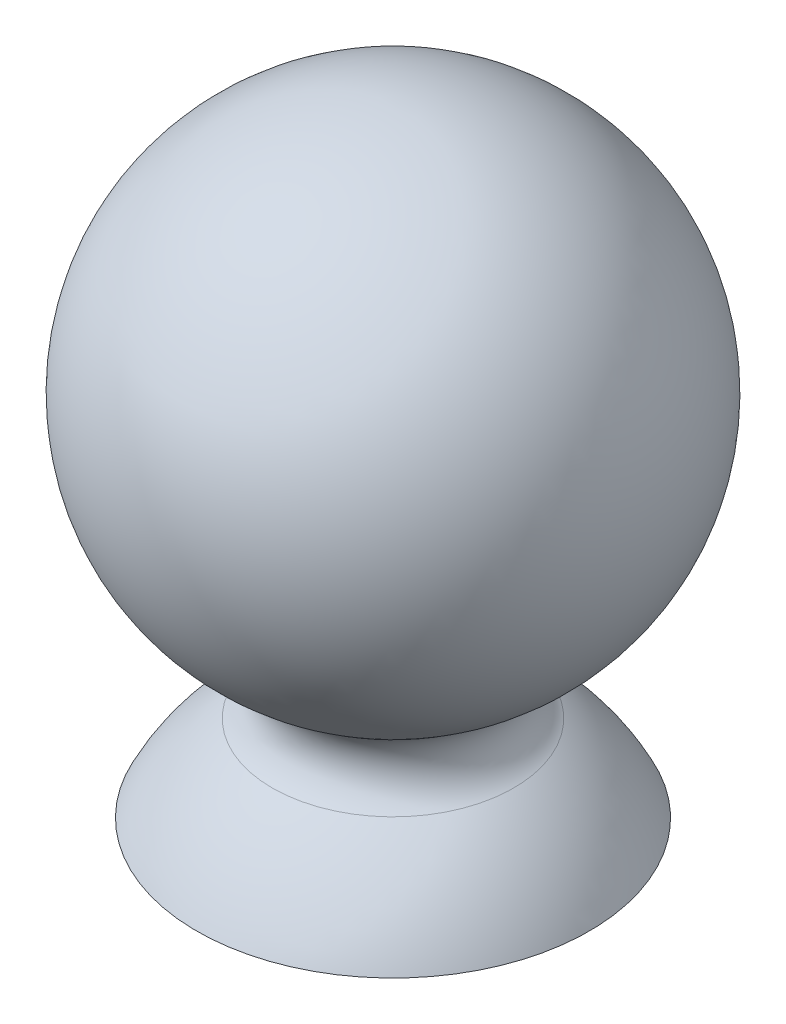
ISO-10303-21;
HEADER;
FILE_DESCRIPTION(('STEP AP214'),'2;1');
FILE_NAME('part.step','',(''),(''),'','','');
FILE_SCHEMA(('AUTOMOTIVE_DESIGN { 1 0 10303 214 1 1 1 1 }'));
ENDSEC;
DATA;
#1=APPLICATION_CONTEXT('core data for automotive mechanical design processes');
#2=APPLICATION_PROTOCOL_DEFINITION('international standard','automotive_design',2000,#1);
#3=PRODUCT_CONTEXT('',#1,'mechanical');
#4=PRODUCT('Part','Part','',(#3));
#5=PRODUCT_RELATED_PRODUCT_CATEGORY('part','',(#4));
#6=PRODUCT_DEFINITION_FORMATION('','',#4);
#7=PRODUCT_DEFINITION_CONTEXT('part definition',#1,'design');
#8=PRODUCT_DEFINITION('design','',#6,#7);
#9=PRODUCT_DEFINITION_SHAPE('','',#8);
#10=(LENGTH_UNIT() NAMED_UNIT(*) SI_UNIT(.MILLI.,.METRE.));
#11=(NAMED_UNIT(*) PLANE_ANGLE_UNIT() SI_UNIT($,.RADIAN.));
#12=(NAMED_UNIT(*) SI_UNIT($,.STERADIAN.) SOLID_ANGLE_UNIT());
#13=UNCERTAINTY_MEASURE_WITH_UNIT(LENGTH_MEASURE(1.E-05),#10,'distance_accuracy_value','');
#14=(GEOMETRIC_REPRESENTATION_CONTEXT(3) GLOBAL_UNCERTAINTY_ASSIGNED_CONTEXT((#13)) GLOBAL_UNIT_ASSIGNED_CONTEXT((#10,
#11,#12)) REPRESENTATION_CONTEXT('',''));
#15=CARTESIAN_POINT('',(0.,0.,0.));
#16=DIRECTION('',(0.,0.,1.));
#17=DIRECTION('',(1.,0.,0.));
#18=AXIS2_PLACEMENT_3D('',#15,#16,#17);
#19=CARTESIAN_POINT('',(0.,-45.,0.));
#20=DIRECTION('',(0.,-1.,0.));
#21=DIRECTION('',(0.,0.,-1.));
#22=AXIS2_PLACEMENT_3D('',#19,#20,#21);
#23=PLANE('',#22);
#24=CARTESIAN_POINT('',(0.,-45.,-65.1728853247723));
#25=DIRECTION('',(0.,-1.,0.));
#26=DIRECTION('',(0.,0.,1.));
#27=AXIS2_PLACEMENT_3D('',#24,#25,#26);
#28=CIRCLE('',#27,80.);
#29=CARTESIAN_POINT('',(-13.6534076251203,-45.,13.6534076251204));
#30=VERTEX_POINT('',#29);
#31=CARTESIAN_POINT('',(-17.,-45.,13.));
#32=VERTEX_POINT('',#31);
#33=EDGE_CURVE('E47',#30,#32,#28,.T.);
#34=ORIENTED_EDGE('',*,*,#33,.F.);
#35=CARTESIAN_POINT('',(65.1728853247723,-45.,-6.82649738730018E-13));
#36=DIRECTION('',(0.,-1.,0.));
#37=DIRECTION('',(0.,0.,1.));
#38=AXIS2_PLACEMENT_3D('',#35,#36,#37);
#39=CIRCLE('',#38,80.);
#40=CARTESIAN_POINT('',(-12.9999999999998,-45.,17.0000000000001));
#41=VERTEX_POINT('',#40);
#42=EDGE_CURVE('E310',#41,#30,#39,.T.);
#43=ORIENTED_EDGE('',*,*,#42,.F.);
#44=DIRECTION('',(-1.,0.,0.));
#45=VECTOR('',#44,1.);
#46=CARTESIAN_POINT('',(-12.9999999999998,-45.,17.0000000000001));
#47=LINE('',#46,#45);
#48=CARTESIAN_POINT('',(-9.99999999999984,-45.,17.0000000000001));
#49=VERTEX_POINT('',#48);
#50=EDGE_CURVE('E468',#49,#41,#47,.T.);
#51=ORIENTED_EDGE('',*,*,#50,.F.);
#52=CARTESIAN_POINT('',(67.4051839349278,-45.,-7.06031825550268E-13));
#53=DIRECTION('',(0.,1.,0.));
#54=DIRECTION('',(0.,0.,1.));
#55=AXIS2_PLACEMENT_3D('',#52,#53,#54);
#56=CIRCLE('',#55,79.25);
#57=CARTESIAN_POINT('',(-10.5758880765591,-45.,14.1249746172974));
#58=VERTEX_POINT('',#57);
#59=EDGE_CURVE('E465',#58,#49,#56,.T.);
#60=ORIENTED_EDGE('',*,*,#59,.F.);
#61=CARTESIAN_POINT('',(0.,-45.,-65.1728853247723));
#62=DIRECTION('',(0.,-1.,0.));
#63=DIRECTION('',(0.,0.,1.));
#64=AXIS2_PLACEMENT_3D('',#61,#62,#63);
#65=CIRCLE('',#64,80.);
#66=CARTESIAN_POINT('',(10.5758880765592,-45.,14.1249746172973));
#67=VERTEX_POINT('',#66);
#68=EDGE_CURVE('E462',#67,#58,#65,.T.);
#69=ORIENTED_EDGE('',*,*,#68,.F.);
#70=CARTESIAN_POINT('',(-67.4051839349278,-45.,2.38813388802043E-13));
#71=DIRECTION('',(0.,1.,0.));
#72=DIRECTION('',(0.,0.,1.));
#73=AXIS2_PLACEMENT_3D('',#70,#71,#72);
#74=CIRCLE('',#73,79.25);
#75=CARTESIAN_POINT('',(10.0000000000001,-45.,17.));
#76=VERTEX_POINT('',#75);
#77=EDGE_CURVE('E459',#76,#67,#74,.T.);
#78=ORIENTED_EDGE('',*,*,#77,.F.);
#79=DIRECTION('',(-1.,0.,0.));
#80=VECTOR('',#79,1.);
#81=CARTESIAN_POINT('',(13.0000000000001,-45.,17.));
#82=LINE('',#81,#80);
#83=CARTESIAN_POINT('',(13.0000000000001,-45.,17.));
#84=VERTEX_POINT('',#83);
#85=EDGE_CURVE('E456',#84,#76,#82,.T.);
#86=ORIENTED_EDGE('',*,*,#85,.F.);
#87=CARTESIAN_POINT('',(-65.1728853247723,-45.,2.3101935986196E-13));
#88=DIRECTION('',(0.,-1.,0.));
#89=DIRECTION('',(0.,0.,1.));
#90=AXIS2_PLACEMENT_3D('',#87,#88,#89);
#91=CIRCLE('',#90,80.);
#92=CARTESIAN_POINT('',(13.6534076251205,-45.,13.6534076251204));
#93=VERTEX_POINT('',#92);
#94=EDGE_CURVE('E453',#93,#84,#91,.T.);
#95=ORIENTED_EDGE('',*,*,#94,.F.);
#96=CARTESIAN_POINT('',(0.,-45.,-65.1728853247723));
#97=DIRECTION('',(0.,-1.,0.));
#98=DIRECTION('',(0.,0.,1.));
#99=AXIS2_PLACEMENT_3D('',#96,#97,#98);
#100=CIRCLE('',#99,80.);
#101=CARTESIAN_POINT('',(17.,-45.,13.));
#102=VERTEX_POINT('',#101);
#103=EDGE_CURVE('E450',#102,#93,#100,.T.);
#104=ORIENTED_EDGE('',*,*,#103,.F.);
#105=DIRECTION('',(0.,0.,1.));
#106=VECTOR('',#105,1.);
#107=CARTESIAN_POINT('',(17.,-45.,13.));
#108=LINE('',#107,#106);
#109=CARTESIAN_POINT('',(17.,-45.,9.99999999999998));
#110=VERTEX_POINT('',#109);
#111=EDGE_CURVE('E447',#110,#102,#108,.T.);
#112=ORIENTED_EDGE('',*,*,#111,.F.);
#113=CARTESIAN_POINT('',(0.,-45.,-67.4051839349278));
#114=DIRECTION('',(0.,1.,0.));
#115=DIRECTION('',(0.,0.,1.));
#116=AXIS2_PLACEMENT_3D('',#113,#114,#115);
#117=CIRCLE('',#116,79.25);
#118=CARTESIAN_POINT('',(14.1249746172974,-45.,10.5758880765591));
#119=VERTEX_POINT('',#118);
#120=EDGE_CURVE('E444',#119,#110,#117,.T.);
#121=ORIENTED_EDGE('',*,*,#120,.F.);
#122=CARTESIAN_POINT('',(-65.1728853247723,-45.,2.3101935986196E-13));
#123=DIRECTION('',(0.,-1.,0.));
#124=DIRECTION('',(0.,0.,1.));
#125=AXIS2_PLACEMENT_3D('',#122,#123,#124);
#126=CIRCLE('',#125,80.);
#127=CARTESIAN_POINT('',(14.1249746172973,-45.,-10.5758880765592));
#128=VERTEX_POINT('',#127);
#129=EDGE_CURVE('E441',#128,#119,#126,.T.);
#130=ORIENTED_EDGE('',*,*,#129,.F.);
#131=CARTESIAN_POINT('',(4.70687883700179E-13,-45.,67.4051839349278));
#132=DIRECTION('',(0.,1.,0.));
#133=DIRECTION('',(0.,0.,1.));
#134=AXIS2_PLACEMENT_3D('',#131,#132,#133);
#135=CIRCLE('',#134,79.25);
#136=CARTESIAN_POINT('',(16.9999999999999,-45.,-10.0000000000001));
#137=VERTEX_POINT('',#136);
#138=EDGE_CURVE('E438',#137,#128,#135,.T.);
#139=ORIENTED_EDGE('',*,*,#138,.F.);
#140=DIRECTION('',(0.,0.,1.));
#141=VECTOR('',#140,1.);
#142=CARTESIAN_POINT('',(16.9999999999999,-45.,-13.0000000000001));
#143=LINE('',#142,#141);
#144=CARTESIAN_POINT('',(16.9999999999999,-45.,-13.0000000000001));
#145=VERTEX_POINT('',#144);
#146=EDGE_CURVE('E435',#145,#137,#143,.T.);
#147=ORIENTED_EDGE('',*,*,#146,.F.);
#148=CARTESIAN_POINT('',(4.55099825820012E-13,-45.,65.1728853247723));
#149=DIRECTION('',(0.,-1.,0.));
#150=DIRECTION('',(0.,0.,1.));
#151=AXIS2_PLACEMENT_3D('',#148,#149,#150);
#152=CIRCLE('',#151,80.);
#153=CARTESIAN_POINT('',(13.6534076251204,-45.,-13.6534076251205));
#154=VERTEX_POINT('',#153);
#155=EDGE_CURVE('E432',#154,#145,#152,.T.);
#156=ORIENTED_EDGE('',*,*,#155,.F.);
#157=CARTESIAN_POINT('',(-65.1728853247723,-45.,2.3101935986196E-13));
#158=DIRECTION('',(0.,-1.,0.));
#159=DIRECTION('',(0.,0.,1.));
#160=AXIS2_PLACEMENT_3D('',#157,#158,#159);
#161=CIRCLE('',#160,80.);
#162=CARTESIAN_POINT('',(12.9999999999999,-45.,-17.));
#163=VERTEX_POINT('',#162);
#164=EDGE_CURVE('E429',#163,#154,#161,.T.);
#165=ORIENTED_EDGE('',*,*,#164,.F.);
#166=DIRECTION('',(1.,0.,0.));
#167=VECTOR('',#166,1.);
#168=CARTESIAN_POINT('',(12.9999999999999,-45.,-17.));
#169=LINE('',#168,#167);
#170=CARTESIAN_POINT('',(9.99999999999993,-45.,-17.));
#171=VERTEX_POINT('',#170);
#172=EDGE_CURVE('E426',#171,#163,#169,.T.);
#173=ORIENTED_EDGE('',*,*,#172,.F.);
#174=CARTESIAN_POINT('',(-67.4051839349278,-45.,2.38813388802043E-13));
#175=DIRECTION('',(0.,1.,0.));
#176=DIRECTION('',(0.,0.,1.));
#177=AXIS2_PLACEMENT_3D('',#174,#175,#176);
#178=CIRCLE('',#177,79.25);
#179=CARTESIAN_POINT('',(10.575888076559,-45.,-14.1249746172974));
#180=VERTEX_POINT('',#179);
#181=EDGE_CURVE('E423',#180,#171,#178,.T.);
#182=ORIENTED_EDGE('',*,*,#181,.F.);
#183=CARTESIAN_POINT('',(4.55099825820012E-13,-45.,65.1728853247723));
#184=DIRECTION('',(0.,-1.,0.));
#185=DIRECTION('',(0.,0.,1.));
#186=AXIS2_PLACEMENT_3D('',#183,#184,#185);
#187=CIRCLE('',#186,80.);
#188=CARTESIAN_POINT('',(-10.5758880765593,-45.,-14.1249746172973));
#189=VERTEX_POINT('',#188);
#190=EDGE_CURVE('E420',#189,#180,#187,.T.);
#191=ORIENTED_EDGE('',*,*,#190,.F.);
#192=CARTESIAN_POINT('',(67.4051839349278,-45.,-7.06031825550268E-13));
#193=DIRECTION('',(0.,1.,0.));
#194=DIRECTION('',(0.,0.,1.));
#195=AXIS2_PLACEMENT_3D('',#192,#193,#194);
#196=CIRCLE('',#195,79.25);
#197=CARTESIAN_POINT('',(-10.0000000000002,-45.,-16.9999999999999));
#198=VERTEX_POINT('',#197);
#199=EDGE_CURVE('E417',#198,#189,#196,.T.);
#200=ORIENTED_EDGE('',*,*,#199,.F.);
#201=DIRECTION('',(1.,0.,0.));
#202=VECTOR('',#201,1.);
#203=CARTESIAN_POINT('',(-13.0000000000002,-45.,-16.9999999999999));
#204=LINE('',#203,#202);
#205=CARTESIAN_POINT('',(-13.0000000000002,-45.,-16.9999999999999));
#206=VERTEX_POINT('',#205);
#207=EDGE_CURVE('E414',#206,#198,#204,.T.);
#208=ORIENTED_EDGE('',*,*,#207,.F.);
#209=CARTESIAN_POINT('',(65.1728853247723,-45.,-6.82649738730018E-13));
#210=DIRECTION('',(0.,-1.,0.));
#211=DIRECTION('',(0.,0.,1.));
#212=AXIS2_PLACEMENT_3D('',#209,#210,#211);
#213=CIRCLE('',#212,80.);
#214=CARTESIAN_POINT('',(-13.6534076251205,-45.,-13.6534076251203));
#215=VERTEX_POINT('',#214);
#216=EDGE_CURVE('E411',#215,#206,#213,.T.);
#217=ORIENTED_EDGE('',*,*,#216,.F.);
#218=CARTESIAN_POINT('',(4.55099825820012E-13,-45.,65.1728853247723));
#219=DIRECTION('',(0.,-1.,0.));
#220=DIRECTION('',(0.,0.,1.));
#221=AXIS2_PLACEMENT_3D('',#218,#219,#220);
#222=CIRCLE('',#221,80.);
#223=CARTESIAN_POINT('',(-17.0000000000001,-45.,-12.9999999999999));
#224=VERTEX_POINT('',#223);
#225=EDGE_CURVE('E408',#224,#215,#222,.T.);
#226=ORIENTED_EDGE('',*,*,#225,.F.);
#227=DIRECTION('',(0.,0.,-1.));
#228=VECTOR('',#227,1.);
#229=CARTESIAN_POINT('',(-17.0000000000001,-45.,-12.9999999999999));
#230=LINE('',#229,#228);
#231=CARTESIAN_POINT('',(-17.,-45.,-9.99999999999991));
#232=VERTEX_POINT('',#231);
#233=EDGE_CURVE('E405',#232,#224,#230,.T.);
#234=ORIENTED_EDGE('',*,*,#233,.F.);
#235=CARTESIAN_POINT('',(4.70687883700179E-13,-45.,67.4051839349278));
#236=DIRECTION('',(0.,1.,0.));
#237=DIRECTION('',(0.,0.,1.));
#238=AXIS2_PLACEMENT_3D('',#235,#236,#237);
#239=CIRCLE('',#238,79.25);
#240=CARTESIAN_POINT('',(-14.1249746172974,-45.,-10.5758880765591));
#241=VERTEX_POINT('',#240);
#242=EDGE_CURVE('E402',#241,#232,#239,.T.);
#243=ORIENTED_EDGE('',*,*,#242,.F.);
#244=CARTESIAN_POINT('',(65.1728853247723,-45.,-6.82649738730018E-13));
#245=DIRECTION('',(0.,-1.,0.));
#246=DIRECTION('',(0.,0.,1.));
#247=AXIS2_PLACEMENT_3D('',#244,#245,#246);
#248=CIRCLE('',#247,80.);
#249=CARTESIAN_POINT('',(-14.1249746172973,-45.,10.5758880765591));
#250=VERTEX_POINT('',#249);
#251=EDGE_CURVE('E399',#250,#241,#248,.T.);
#252=ORIENTED_EDGE('',*,*,#251,.F.);
#253=CARTESIAN_POINT('',(0.,-45.,-67.4051839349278));
#254=DIRECTION('',(0.,1.,0.));
#255=DIRECTION('',(0.,0.,1.));
#256=AXIS2_PLACEMENT_3D('',#253,#254,#255);
#257=CIRCLE('',#256,79.25);
#258=CARTESIAN_POINT('',(-17.,-45.,10.));
#259=VERTEX_POINT('',#258);
#260=EDGE_CURVE('E396',#259,#250,#257,.T.);
#261=ORIENTED_EDGE('',*,*,#260,.F.);
#262=DIRECTION('',(0.,0.,-1.));
#263=VECTOR('',#262,1.);
#264=CARTESIAN_POINT('',(-17.,-45.,13.));
#265=LINE('',#264,#263);
#266=EDGE_CURVE('E393',#32,#259,#265,.T.);
#267=ORIENTED_EDGE('',*,*,#266,.F.);
#268=EDGE_LOOP('',(#34,#43,#51,#60,#69,#78,#86,#95,#104,#112,#121,#130,#139,#147,#156,#165,#173,
#182,#191,#200,#208,#217,#226,#234,#243,#252,#261,#267));
#269=FACE_BOUND('',#268,.T.);
#270=CARTESIAN_POINT('',(0.,-45.,0.));
#271=DIRECTION('',(0.,1.,0.));
#272=DIRECTION('',(0.,0.,1.));
#273=AXIS2_PLACEMENT_3D('',#270,#271,#272);
#274=CIRCLE('',#273,24.);
#275=CARTESIAN_POINT('',(-24.,-45.,0.));
#276=VERTEX_POINT('',#275);
#277=EDGE_CURVE('E554',#276,#276,#274,.T.);
#278=ORIENTED_EDGE('',*,*,#277,.F.);
#279=EDGE_LOOP('',(#278));
#280=FACE_BOUND('',#279,.T.);
#281=ADVANCED_FACE('F33',(#269,#280),#23,.T.);
#282=CARTESIAN_POINT('',(0.,0.,0.));
#283=DIRECTION('',(0.,1.,0.));
#284=DIRECTION('',(1.,0.,0.));
#285=AXIS2_PLACEMENT_3D('',#282,#283,#284);
#286=SPHERICAL_SURFACE('',#285,30.);
#287=CARTESIAN_POINT('',(0.,-25.9637188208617,0.));
#288=DIRECTION('',(0.,1.,0.));
#289=DIRECTION('',(0.,0.,1.));
#290=AXIS2_PLACEMENT_3D('',#287,#288,#289);
#291=CIRCLE('',#290,15.0294811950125);
#292=CARTESIAN_POINT('',(0.,-25.9637188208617,15.0294811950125));
#293=VERTEX_POINT('',#292);
#294=EDGE_CURVE('E11',#293,#293,#291,.T.);
#295=ORIENTED_EDGE('',*,*,#294,.T.);
#296=EDGE_LOOP('',(#295));
#297=FACE_BOUND('',#296,.T.);
#298=ADVANCED_FACE('F580',(#297),#286,.T.);
#299=CARTESIAN_POINT('',(0.,-30.2910052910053,0.));
#300=DIRECTION('',(0.,1.,0.));
#301=DIRECTION('',(0.,0.,1.));
#302=AXIS2_PLACEMENT_3D('',#299,#300,#301);
#303=TOROIDAL_SURFACE('',#302,17.5343947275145,4.99999999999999);
#304=CARTESIAN_POINT('',(0.,-34.4564618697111,0.));
#305=DIRECTION('',(0.,1.,0.));
#306=DIRECTION('',(0.,0.,1.));
#307=AXIS2_PLACEMENT_3D('',#304,#305,#306);
#308=CIRCLE('',#307,14.7687173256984);
#309=CARTESIAN_POINT('',(-14.7687173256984,-34.4564618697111,0.));
#310=VERTEX_POINT('',#309);
#311=EDGE_CURVE('E40',#310,#310,#308,.T.);
#312=ORIENTED_EDGE('',*,*,#311,.T.);
#313=EDGE_LOOP('',(#312));
#314=FACE_BOUND('',#313,.T.);
#315=ORIENTED_EDGE('',*,*,#294,.F.);
#316=EDGE_LOOP('',(#315));
#317=FACE_BOUND('',#316,.T.);
#318=ADVANCED_FACE('F565',(#314,#317),#303,.F.);
#319=CARTESIAN_POINT('',(0.,-56.7,0.));
#320=DIRECTION('',(0.,1.,0.));
#321=DIRECTION('',(-1.,0.,0.));
#322=AXIS2_PLACEMENT_3D('',#319,#320,#321);
#323=SPHERICAL_SURFACE('',#322,26.7);
#324=CARTESIAN_POINT('',(-24.,-45.,0.));
#325=CARTESIAN_POINT('',(-23.9352752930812,-44.8672310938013,0.));
#326=CARTESIAN_POINT('',(-23.8694486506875,-44.7349993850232,0.));
#327=CARTESIAN_POINT('',(-23.7356100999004,-44.4716465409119,0.));
#328=CARTESIAN_POINT('',(-23.6675981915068,-44.3405254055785,0.));
#329=CARTESIAN_POINT('',(-23.5294077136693,-44.07942988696,0.));
#330=CARTESIAN_POINT('',(-23.4592291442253,-43.9494555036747,0.));
#331=CARTESIAN_POINT('',(-23.31672470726,-43.690689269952,0.));
#332=CARTESIAN_POINT('',(-23.2443988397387,-43.5618974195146,0.));
#333=CARTESIAN_POINT('',(-23.0976197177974,-43.30553172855,0.));
#334=CARTESIAN_POINT('',(-23.0231664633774,-43.1779578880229,0.));
#335=CARTESIAN_POINT('',(-22.8721530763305,-42.9240633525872,0.));
#336=CARTESIAN_POINT('',(-22.7955929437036,-42.7977426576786,0.));
#337=CARTESIAN_POINT('',(-22.6403868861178,-42.5463892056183,0.));
#338=CARTESIAN_POINT('',(-22.5617409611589,-42.4213564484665,0.));
#339=CARTESIAN_POINT('',(-22.4023849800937,-42.1726133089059,0.));
#340=CARTESIAN_POINT('',(-22.3216749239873,-42.048902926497,0.));
#341=CARTESIAN_POINT('',(-22.1582129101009,-41.8028386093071,0.));
#342=CARTESIAN_POINT('',(-22.0754609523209,-41.6804846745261,0.));
#343=CARTESIAN_POINT('',(-21.9079379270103,-41.4371669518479,0.));
#344=CARTESIAN_POINT('',(-21.8231668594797,-41.3162031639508,0.));
#345=CARTESIAN_POINT('',(-21.6516289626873,-41.0756990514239,0.));
#346=CARTESIAN_POINT('',(-21.5648621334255,-40.9561587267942,0.));
#347=CARTESIAN_POINT('',(-21.3893566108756,-40.718534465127,0.));
#348=CARTESIAN_POINT('',(-21.3006179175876,-40.6004505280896,0.));
#349=CARTESIAN_POINT('',(-21.1211931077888,-40.3657715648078,0.));
#350=CARTESIAN_POINT('',(-21.030506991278,-40.2491765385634,0.));
#351=CARTESIAN_POINT('',(-20.8472123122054,-40.0175075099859,0.));
#352=CARTESIAN_POINT('',(-20.7546037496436,-39.9024335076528,0.));
#353=CARTESIAN_POINT('',(-20.5674896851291,-39.6738382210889,0.));
#354=CARTESIAN_POINT('',(-20.4729841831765,-39.5603169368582,0.));
#355=CARTESIAN_POINT('',(-20.282102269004,-39.3348583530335,0.));
#356=CARTESIAN_POINT('',(-20.1857258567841,-39.2229210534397,0.));
#357=CARTESIAN_POINT('',(-19.9911286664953,-39.0006612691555,0.));
#358=CARTESIAN_POINT('',(-19.8929078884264,-38.8903387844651,0.));
#359=CARTESIAN_POINT('',(-19.6946490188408,-38.6713390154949,0.));
#360=CARTESIAN_POINT('',(-19.5946109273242,-38.562661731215,0.));
#361=CARTESIAN_POINT('',(-19.3927449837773,-38.3469822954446,0.));
#362=CARTESIAN_POINT('',(-19.290917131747,-38.2399801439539,0.));
#363=CARTESIAN_POINT('',(-19.0854997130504,-38.0276804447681,0.));
#364=CARTESIAN_POINT('',(-18.9819101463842,-37.9223828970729,0.));
#365=CARTESIAN_POINT('',(-18.7729978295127,-37.7135214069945,0.));
#366=CARTESIAN_POINT('',(-18.6676750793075,-37.6099574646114,0.));
#367=CARTESIAN_POINT('',(-18.4553254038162,-37.4045917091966,0.));
#368=CARTESIAN_POINT('',(-18.3482984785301,-37.3027898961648,0.));
#369=CARTESIAN_POINT('',(-18.1325699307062,-37.1009764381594,0.));
#370=CARTESIAN_POINT('',(-18.0238683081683,-37.0009647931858,0.));
#371=CARTESIAN_POINT('',(-17.8048203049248,-36.8027592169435,0.));
#372=CARTESIAN_POINT('',(-17.6944739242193,-36.7045652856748,0.));
#373=CARTESIAN_POINT('',(-17.472166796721,-36.5100221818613,0.));
#374=CARTESIAN_POINT('',(-17.3602060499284,-36.4136730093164,0.));
#375=CARTESIAN_POINT('',(-17.1347010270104,-36.2228459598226,0.));
#376=CARTESIAN_POINT('',(-17.021156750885,-36.1283680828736,0.));
#377=CARTESIAN_POINT('',(-16.7925159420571,-35.941309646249,0.));
#378=CARTESIAN_POINT('',(-16.6774194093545,-35.8487290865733,0.));
#379=CARTESIAN_POINT('',(-16.4457057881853,-35.665490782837,0.));
#380=CARTESIAN_POINT('',(-16.3290886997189,-35.5748330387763,0.));
#381=CARTESIAN_POINT('',(-16.0943660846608,-35.3954653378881,0.));
#382=CARTESIAN_POINT('',(-15.9762605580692,-35.3067553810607,0.));
#383=CARTESIAN_POINT('',(-15.7385936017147,-35.1313076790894,0.));
#384=CARTESIAN_POINT('',(-15.6190321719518,-35.0445699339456,0.));
#385=CARTESIAN_POINT('',(-15.3784863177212,-34.8730905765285,0.));
#386=CARTESIAN_POINT('',(-15.2575018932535,-34.7883489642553,0.));
#387=CARTESIAN_POINT('',(-15.014143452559,-34.6208850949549,0.));
#388=CARTESIAN_POINT('',(-14.8917694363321,-34.5381628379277,0.));
#389=CARTESIAN_POINT('',(-14.7687173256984,-34.4564618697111,0.));
#390=B_SPLINE_CURVE_WITH_KNOTS('',3,(#324,#325,#326,#327,#328,#329,#330,#331,#332,#333,#334,
#335,#336,#337,#338,#339,#340,#341,#342,#343,#344,#345,#346,#347,#348,#349,#350,#351,#352,#353,
#354,#355,#356,#357,#358,#359,#360,#361,#362,#363,#364,#365,#366,#367,#368,#369,#370,#371,#372,
#373,#374,#375,#376,#377,#378,#379,#380,#381,#382,#383,#384,#385,#386,#387,#388,#389),
.UNSPECIFIED.,.F.,.F.,(4,2,2,2,2,2,2,2,2,2,2,2,2,2,2,2,2,2,2,2,2,2,2,2,2,2,2,2,2,2,2,2,4),(0.,
0.443110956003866,0.886221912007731,1.3293328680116,1.77244382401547,2.21555478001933,
2.6586657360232,3.10177669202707,3.54488764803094,3.98799860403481,4.43110956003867,
4.87422051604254,5.31733147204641,5.76044242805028,6.20355338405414,6.64666434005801,
7.08977529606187,7.53288625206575,7.97599720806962,8.41910816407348,8.86221912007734,
9.30533007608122,9.74844103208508,10.1915519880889,10.6346629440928,11.0777739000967,
11.5208848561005,11.9639958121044,12.4071067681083,12.8502177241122,13.293328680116,
13.7364396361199,14.1795505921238),.UNSPECIFIED.);
#391=EDGE_CURVE('BSEAM568',#276,#310,#390,.T.);
#392=ORIENTED_EDGE('',*,*,#277,.T.);
#393=ORIENTED_EDGE('',*,*,#311,.F.);
#394=ORIENTED_EDGE('',*,*,#391,.T.);
#395=ORIENTED_EDGE('',*,*,#391,.F.);
#396=EDGE_LOOP('',(#392,#394,#393,#395));
#397=FACE_BOUND('',#396,.T.);
#398=ADVANCED_FACE('F568',(#397),#323,.T.);
#399=CARTESIAN_POINT('',(0.,-41.,-65.1728853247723));
#400=DIRECTION('',(0.,-1.,0.));
#401=DIRECTION('',(0.,0.,-1.));
#402=AXIS2_PLACEMENT_3D('',#399,#400,#401);
#403=CYLINDRICAL_SURFACE('',#402,80.);
#404=ORIENTED_EDGE('',*,*,#33,.T.);
#405=DIRECTION('',(0.,-1.,0.));
#406=VECTOR('',#405,1.);
#407=CARTESIAN_POINT('',(-17.,-41.,13.));
#408=LINE('',#407,#406);
#409=CARTESIAN_POINT('',(-17.,-41.,13.));
#410=VERTEX_POINT('',#409);
#411=EDGE_CURVE('E391',#410,#32,#408,.T.);
#412=ORIENTED_EDGE('',*,*,#411,.F.);
#413=CARTESIAN_POINT('',(0.,-41.,-65.1728853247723));
#414=DIRECTION('',(0.,-1.,0.));
#415=DIRECTION('',(0.,0.,1.));
#416=AXIS2_PLACEMENT_3D('',#413,#414,#415);
#417=CIRCLE('',#416,80.);
#418=CARTESIAN_POINT('',(-13.6534076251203,-41.,13.6534076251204));
#419=VERTEX_POINT('',#418);
#420=EDGE_CURVE('E306',#419,#410,#417,.T.);
#421=ORIENTED_EDGE('',*,*,#420,.F.);
#422=DIRECTION('',(0.,-1.,0.));
#423=VECTOR('',#422,1.);
#424=CARTESIAN_POINT('',(-13.6534076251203,-41.,13.6534076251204));
#425=LINE('',#424,#423);
#426=EDGE_CURVE('E473',#419,#30,#425,.T.);
#427=ORIENTED_EDGE('',*,*,#426,.T.);
#428=EDGE_LOOP('',(#404,#412,#421,#427));
#429=FACE_BOUND('',#428,.T.);
#430=ADVANCED_FACE('F570',(#429),#403,.F.);
#431=CARTESIAN_POINT('',(65.1728853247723,-41.,-6.82649738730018E-13));
#432=DIRECTION('',(0.,-1.,0.));
#433=DIRECTION('',(0.,0.,-1.));
#434=AXIS2_PLACEMENT_3D('',#431,#432,#433);
#435=CYLINDRICAL_SURFACE('',#434,80.);
#436=ORIENTED_EDGE('',*,*,#42,.T.);
#437=ORIENTED_EDGE('',*,*,#426,.F.);
#438=CARTESIAN_POINT('',(65.1728853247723,-41.,-6.82649738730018E-13));
#439=DIRECTION('',(0.,-1.,0.));
#440=DIRECTION('',(0.,0.,1.));
#441=AXIS2_PLACEMENT_3D('',#438,#439,#440);
#442=CIRCLE('',#441,80.);
#443=CARTESIAN_POINT('',(-12.9999999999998,-41.,17.0000000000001));
#444=VERTEX_POINT('',#443);
#445=EDGE_CURVE('E388',#444,#419,#442,.T.);
#446=ORIENTED_EDGE('',*,*,#445,.F.);
#447=DIRECTION('',(0.,-1.,0.));
#448=VECTOR('',#447,1.);
#449=CARTESIAN_POINT('',(-12.9999999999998,-41.,17.0000000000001));
#450=LINE('',#449,#448);
#451=EDGE_CURVE('E476',#444,#41,#450,.T.);
#452=ORIENTED_EDGE('',*,*,#451,.T.);
#453=EDGE_LOOP('',(#436,#437,#446,#452));
#454=FACE_BOUND('',#453,.T.);
#455=ADVANCED_FACE('F578',(#454),#435,.F.);
#456=CARTESIAN_POINT('',(-12.9999999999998,-41.,17.0000000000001));
#457=DIRECTION('',(0.,0.,1.));
#458=DIRECTION('',(1.,0.,0.));
#459=AXIS2_PLACEMENT_3D('',#456,#457,#458);
#460=PLANE('',#459);
#461=ORIENTED_EDGE('',*,*,#50,.T.);
#462=ORIENTED_EDGE('',*,*,#451,.F.);
#463=DIRECTION('',(-1.,0.,0.));
#464=VECTOR('',#463,1.);
#465=CARTESIAN_POINT('',(-12.9999999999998,-41.,17.0000000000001));
#466=LINE('',#465,#464);
#467=CARTESIAN_POINT('',(-9.99999999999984,-41.,17.0000000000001));
#468=VERTEX_POINT('',#467);
#469=EDGE_CURVE('E385',#468,#444,#466,.T.);
#470=ORIENTED_EDGE('',*,*,#469,.F.);
#471=DIRECTION('',(0.,-1.,0.));
#472=VECTOR('',#471,1.);
#473=CARTESIAN_POINT('',(-9.99999999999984,-41.,17.0000000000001));
#474=LINE('',#473,#472);
#475=EDGE_CURVE('E478',#468,#49,#474,.T.);
#476=ORIENTED_EDGE('',*,*,#475,.T.);
#477=EDGE_LOOP('',(#461,#462,#470,#476));
#478=FACE_BOUND('',#477,.T.);
#479=ADVANCED_FACE('F626',(#478),#460,.F.);
#480=CARTESIAN_POINT('',(67.4051839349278,-41.,-7.06031825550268E-13));
#481=DIRECTION('',(0.,-1.,0.));
#482=DIRECTION('',(0.,0.,-1.));
#483=AXIS2_PLACEMENT_3D('',#480,#481,#482);
#484=CYLINDRICAL_SURFACE('',#483,79.25);
#485=ORIENTED_EDGE('',*,*,#59,.T.);
#486=ORIENTED_EDGE('',*,*,#475,.F.);
#487=CARTESIAN_POINT('',(67.4051839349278,-41.,-7.06031825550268E-13));
#488=DIRECTION('',(0.,1.,0.));
#489=DIRECTION('',(0.,0.,1.));
#490=AXIS2_PLACEMENT_3D('',#487,#488,#489);
#491=CIRCLE('',#490,79.25);
#492=CARTESIAN_POINT('',(-10.5758880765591,-41.,14.1249746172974));
#493=VERTEX_POINT('',#492);
#494=EDGE_CURVE('E382',#493,#468,#491,.T.);
#495=ORIENTED_EDGE('',*,*,#494,.F.);
#496=DIRECTION('',(0.,-1.,0.));
#497=VECTOR('',#496,1.);
#498=CARTESIAN_POINT('',(-10.5758880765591,-41.,14.1249746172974));
#499=LINE('',#498,#497);
#500=EDGE_CURVE('E480',#493,#58,#499,.T.);
#501=ORIENTED_EDGE('',*,*,#500,.T.);
#502=EDGE_LOOP('',(#485,#486,#495,#501));
#503=FACE_BOUND('',#502,.T.);
#504=ADVANCED_FACE('F630',(#503),#484,.T.);
#505=CARTESIAN_POINT('',(0.,-41.,-65.1728853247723));
#506=DIRECTION('',(0.,-1.,0.));
#507=DIRECTION('',(0.,0.,-1.));
#508=AXIS2_PLACEMENT_3D('',#505,#506,#507);
#509=CYLINDRICAL_SURFACE('',#508,80.);
#510=ORIENTED_EDGE('',*,*,#68,.T.);
#511=ORIENTED_EDGE('',*,*,#500,.F.);
#512=CARTESIAN_POINT('',(0.,-41.,-65.1728853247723));
#513=DIRECTION('',(0.,-1.,0.));
#514=DIRECTION('',(0.,0.,1.));
#515=AXIS2_PLACEMENT_3D('',#512,#513,#514);
#516=CIRCLE('',#515,80.);
#517=CARTESIAN_POINT('',(10.5758880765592,-41.,14.1249746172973));
#518=VERTEX_POINT('',#517);
#519=EDGE_CURVE('E379',#518,#493,#516,.T.);
#520=ORIENTED_EDGE('',*,*,#519,.F.);
#521=DIRECTION('',(0.,-1.,0.));
#522=VECTOR('',#521,1.);
#523=CARTESIAN_POINT('',(10.5758880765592,-41.,14.1249746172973));
#524=LINE('',#523,#522);
#525=EDGE_CURVE('E482',#518,#67,#524,.T.);
#526=ORIENTED_EDGE('',*,*,#525,.T.);
#527=EDGE_LOOP('',(#510,#511,#520,#526));
#528=FACE_BOUND('',#527,.T.);
#529=ADVANCED_FACE('F634',(#528),#509,.F.);
#530=CARTESIAN_POINT('',(-67.4051839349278,-41.,2.38813388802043E-13));
#531=DIRECTION('',(0.,-1.,0.));
#532=DIRECTION('',(0.,0.,-1.));
#533=AXIS2_PLACEMENT_3D('',#530,#531,#532);
#534=CYLINDRICAL_SURFACE('',#533,79.25);
#535=ORIENTED_EDGE('',*,*,#77,.T.);
#536=ORIENTED_EDGE('',*,*,#525,.F.);
#537=CARTESIAN_POINT('',(-67.4051839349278,-41.,2.38813388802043E-13));
#538=DIRECTION('',(0.,1.,0.));
#539=DIRECTION('',(0.,0.,1.));
#540=AXIS2_PLACEMENT_3D('',#537,#538,#539);
#541=CIRCLE('',#540,79.25);
#542=CARTESIAN_POINT('',(10.0000000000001,-41.,17.));
#543=VERTEX_POINT('',#542);
#544=EDGE_CURVE('E376',#543,#518,#541,.T.);
#545=ORIENTED_EDGE('',*,*,#544,.F.);
#546=DIRECTION('',(0.,-1.,0.));
#547=VECTOR('',#546,1.);
#548=CARTESIAN_POINT('',(10.0000000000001,-41.,17.));
#549=LINE('',#548,#547);
#550=EDGE_CURVE('E484',#543,#76,#549,.T.);
#551=ORIENTED_EDGE('',*,*,#550,.T.);
#552=EDGE_LOOP('',(#535,#536,#545,#551));
#553=FACE_BOUND('',#552,.T.);
#554=ADVANCED_FACE('F638',(#553),#534,.T.);
#555=CARTESIAN_POINT('',(13.0000000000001,-41.,17.));
#556=DIRECTION('',(0.,0.,1.));
#557=DIRECTION('',(1.,0.,0.));
#558=AXIS2_PLACEMENT_3D('',#555,#556,#557);
#559=PLANE('',#558);
#560=ORIENTED_EDGE('',*,*,#85,.T.);
#561=ORIENTED_EDGE('',*,*,#550,.F.);
#562=DIRECTION('',(-1.,0.,0.));
#563=VECTOR('',#562,1.);
#564=CARTESIAN_POINT('',(13.0000000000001,-41.,17.));
#565=LINE('',#564,#563);
#566=CARTESIAN_POINT('',(13.0000000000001,-41.,17.));
#567=VERTEX_POINT('',#566);
#568=EDGE_CURVE('E373',#567,#543,#565,.T.);
#569=ORIENTED_EDGE('',*,*,#568,.F.);
#570=DIRECTION('',(0.,-1.,0.));
#571=VECTOR('',#570,1.);
#572=CARTESIAN_POINT('',(13.0000000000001,-41.,17.));
#573=LINE('',#572,#571);
#574=EDGE_CURVE('E486',#567,#84,#573,.T.);
#575=ORIENTED_EDGE('',*,*,#574,.T.);
#576=EDGE_LOOP('',(#560,#561,#569,#575));
#577=FACE_BOUND('',#576,.T.);
#578=ADVANCED_FACE('F642',(#577),#559,.F.);
#579=CARTESIAN_POINT('',(-65.1728853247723,-41.,2.3101935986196E-13));
#580=DIRECTION('',(0.,-1.,0.));
#581=DIRECTION('',(0.,0.,-1.));
#582=AXIS2_PLACEMENT_3D('',#579,#580,#581);
#583=CYLINDRICAL_SURFACE('',#582,80.);
#584=ORIENTED_EDGE('',*,*,#94,.T.);
#585=ORIENTED_EDGE('',*,*,#574,.F.);
#586=CARTESIAN_POINT('',(-65.1728853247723,-41.,2.3101935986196E-13));
#587=DIRECTION('',(0.,-1.,0.));
#588=DIRECTION('',(0.,0.,1.));
#589=AXIS2_PLACEMENT_3D('',#586,#587,#588);
#590=CIRCLE('',#589,80.);
#591=CARTESIAN_POINT('',(13.6534076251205,-41.,13.6534076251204));
#592=VERTEX_POINT('',#591);
#593=EDGE_CURVE('E370',#592,#567,#590,.T.);
#594=ORIENTED_EDGE('',*,*,#593,.F.);
#595=DIRECTION('',(0.,-1.,0.));
#596=VECTOR('',#595,1.);
#597=CARTESIAN_POINT('',(13.6534076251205,-41.,13.6534076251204));
#598=LINE('',#597,#596);
#599=EDGE_CURVE('E488',#592,#93,#598,.T.);
#600=ORIENTED_EDGE('',*,*,#599,.T.);
#601=EDGE_LOOP('',(#584,#585,#594,#600));
#602=FACE_BOUND('',#601,.T.);
#603=ADVANCED_FACE('F646',(#602),#583,.F.);
#604=CARTESIAN_POINT('',(0.,-41.,-65.1728853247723));
#605=DIRECTION('',(0.,-1.,0.));
#606=DIRECTION('',(0.,0.,-1.));
#607=AXIS2_PLACEMENT_3D('',#604,#605,#606);
#608=CYLINDRICAL_SURFACE('',#607,80.);
#609=ORIENTED_EDGE('',*,*,#103,.T.);
#610=ORIENTED_EDGE('',*,*,#599,.F.);
#611=CARTESIAN_POINT('',(0.,-41.,-65.1728853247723));
#612=DIRECTION('',(0.,-1.,0.));
#613=DIRECTION('',(0.,0.,1.));
#614=AXIS2_PLACEMENT_3D('',#611,#612,#613);
#615=CIRCLE('',#614,80.);
#616=CARTESIAN_POINT('',(17.,-41.,13.));
#617=VERTEX_POINT('',#616);
#618=EDGE_CURVE('E367',#617,#592,#615,.T.);
#619=ORIENTED_EDGE('',*,*,#618,.F.);
#620=DIRECTION('',(0.,-1.,0.));
#621=VECTOR('',#620,1.);
#622=CARTESIAN_POINT('',(17.,-41.,13.));
#623=LINE('',#622,#621);
#624=EDGE_CURVE('E490',#617,#102,#623,.T.);
#625=ORIENTED_EDGE('',*,*,#624,.T.);
#626=EDGE_LOOP('',(#609,#610,#619,#625));
#627=FACE_BOUND('',#626,.T.);
#628=ADVANCED_FACE('F650',(#627),#608,.F.);
#629=CARTESIAN_POINT('',(17.,-41.,13.));
#630=DIRECTION('',(1.,0.,0.));
#631=DIRECTION('',(0.,0.,-1.));
#632=AXIS2_PLACEMENT_3D('',#629,#630,#631);
#633=PLANE('',#632);
#634=ORIENTED_EDGE('',*,*,#111,.T.);
#635=ORIENTED_EDGE('',*,*,#624,.F.);
#636=DIRECTION('',(0.,0.,1.));
#637=VECTOR('',#636,1.);
#638=CARTESIAN_POINT('',(17.,-41.,13.));
#639=LINE('',#638,#637);
#640=CARTESIAN_POINT('',(17.,-41.,9.99999999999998));
#641=VERTEX_POINT('',#640);
#642=EDGE_CURVE('E364',#641,#617,#639,.T.);
#643=ORIENTED_EDGE('',*,*,#642,.F.);
#644=DIRECTION('',(0.,-1.,0.));
#645=VECTOR('',#644,1.);
#646=CARTESIAN_POINT('',(17.,-41.,9.99999999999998));
#647=LINE('',#646,#645);
#648=EDGE_CURVE('E492',#641,#110,#647,.T.);
#649=ORIENTED_EDGE('',*,*,#648,.T.);
#650=EDGE_LOOP('',(#634,#635,#643,#649));
#651=FACE_BOUND('',#650,.T.);
#652=ADVANCED_FACE('F654',(#651),#633,.F.);
#653=CARTESIAN_POINT('',(0.,-41.,-67.4051839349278));
#654=DIRECTION('',(0.,-1.,0.));
#655=DIRECTION('',(0.,0.,-1.));
#656=AXIS2_PLACEMENT_3D('',#653,#654,#655);
#657=CYLINDRICAL_SURFACE('',#656,79.25);
#658=ORIENTED_EDGE('',*,*,#120,.T.);
#659=ORIENTED_EDGE('',*,*,#648,.F.);
#660=CARTESIAN_POINT('',(0.,-41.,-67.4051839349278));
#661=DIRECTION('',(0.,1.,0.));
#662=DIRECTION('',(0.,0.,1.));
#663=AXIS2_PLACEMENT_3D('',#660,#661,#662);
#664=CIRCLE('',#663,79.25);
#665=CARTESIAN_POINT('',(14.1249746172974,-41.,10.5758880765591));
#666=VERTEX_POINT('',#665);
#667=EDGE_CURVE('E361',#666,#641,#664,.T.);
#668=ORIENTED_EDGE('',*,*,#667,.F.);
#669=DIRECTION('',(0.,-1.,0.));
#670=VECTOR('',#669,1.);
#671=CARTESIAN_POINT('',(14.1249746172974,-41.,10.5758880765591));
#672=LINE('',#671,#670);
#673=EDGE_CURVE('E494',#666,#119,#672,.T.);
#674=ORIENTED_EDGE('',*,*,#673,.T.);
#675=EDGE_LOOP('',(#658,#659,#668,#674));
#676=FACE_BOUND('',#675,.T.);
#677=ADVANCED_FACE('F658',(#676),#657,.T.);
#678=CARTESIAN_POINT('',(-65.1728853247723,-41.,2.3101935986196E-13));
#679=DIRECTION('',(0.,-1.,0.));
#680=DIRECTION('',(0.,0.,-1.));
#681=AXIS2_PLACEMENT_3D('',#678,#679,#680);
#682=CYLINDRICAL_SURFACE('',#681,80.);
#683=ORIENTED_EDGE('',*,*,#129,.T.);
#684=ORIENTED_EDGE('',*,*,#673,.F.);
#685=CARTESIAN_POINT('',(-65.1728853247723,-41.,2.3101935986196E-13));
#686=DIRECTION('',(0.,-1.,0.));
#687=DIRECTION('',(0.,0.,1.));
#688=AXIS2_PLACEMENT_3D('',#685,#686,#687);
#689=CIRCLE('',#688,80.);
#690=CARTESIAN_POINT('',(14.1249746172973,-41.,-10.5758880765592));
#691=VERTEX_POINT('',#690);
#692=EDGE_CURVE('E358',#691,#666,#689,.T.);
#693=ORIENTED_EDGE('',*,*,#692,.F.);
#694=DIRECTION('',(0.,-1.,0.));
#695=VECTOR('',#694,1.);
#696=CARTESIAN_POINT('',(14.1249746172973,-41.,-10.5758880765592));
#697=LINE('',#696,#695);
#698=EDGE_CURVE('E496',#691,#128,#697,.T.);
#699=ORIENTED_EDGE('',*,*,#698,.T.);
#700=EDGE_LOOP('',(#683,#684,#693,#699));
#701=FACE_BOUND('',#700,.T.);
#702=ADVANCED_FACE('F662',(#701),#682,.F.);
#703=CARTESIAN_POINT('',(4.70687883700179E-13,-41.,67.4051839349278));
#704=DIRECTION('',(0.,-1.,0.));
#705=DIRECTION('',(0.,0.,-1.));
#706=AXIS2_PLACEMENT_3D('',#703,#704,#705);
#707=CYLINDRICAL_SURFACE('',#706,79.25);
#708=ORIENTED_EDGE('',*,*,#138,.T.);
#709=ORIENTED_EDGE('',*,*,#698,.F.);
#710=CARTESIAN_POINT('',(4.70687883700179E-13,-41.,67.4051839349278));
#711=DIRECTION('',(0.,1.,0.));
#712=DIRECTION('',(0.,0.,1.));
#713=AXIS2_PLACEMENT_3D('',#710,#711,#712);
#714=CIRCLE('',#713,79.25);
#715=CARTESIAN_POINT('',(16.9999999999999,-41.,-10.0000000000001));
#716=VERTEX_POINT('',#715);
#717=EDGE_CURVE('E355',#716,#691,#714,.T.);
#718=ORIENTED_EDGE('',*,*,#717,.F.);
#719=DIRECTION('',(0.,-1.,0.));
#720=VECTOR('',#719,1.);
#721=CARTESIAN_POINT('',(16.9999999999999,-41.,-10.0000000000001));
#722=LINE('',#721,#720);
#723=EDGE_CURVE('E498',#716,#137,#722,.T.);
#724=ORIENTED_EDGE('',*,*,#723,.T.);
#725=EDGE_LOOP('',(#708,#709,#718,#724));
#726=FACE_BOUND('',#725,.T.);
#727=ADVANCED_FACE('F666',(#726),#707,.T.);
#728=CARTESIAN_POINT('',(16.9999999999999,-41.,-13.0000000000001));
#729=DIRECTION('',(1.,0.,0.));
#730=DIRECTION('',(0.,0.,-1.));
#731=AXIS2_PLACEMENT_3D('',#728,#729,#730);
#732=PLANE('',#731);
#733=ORIENTED_EDGE('',*,*,#146,.T.);
#734=ORIENTED_EDGE('',*,*,#723,.F.);
#735=DIRECTION('',(0.,0.,1.));
#736=VECTOR('',#735,1.);
#737=CARTESIAN_POINT('',(16.9999999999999,-41.,-13.0000000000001));
#738=LINE('',#737,#736);
#739=CARTESIAN_POINT('',(16.9999999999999,-41.,-13.0000000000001));
#740=VERTEX_POINT('',#739);
#741=EDGE_CURVE('E352',#740,#716,#738,.T.);
#742=ORIENTED_EDGE('',*,*,#741,.F.);
#743=DIRECTION('',(0.,-1.,0.));
#744=VECTOR('',#743,1.);
#745=CARTESIAN_POINT('',(16.9999999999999,-41.,-13.0000000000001));
#746=LINE('',#745,#744);
#747=EDGE_CURVE('E500',#740,#145,#746,.T.);
#748=ORIENTED_EDGE('',*,*,#747,.T.);
#749=EDGE_LOOP('',(#733,#734,#742,#748));
#750=FACE_BOUND('',#749,.T.);
#751=ADVANCED_FACE('F670',(#750),#732,.F.);
#752=CARTESIAN_POINT('',(4.55099825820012E-13,-41.,65.1728853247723));
#753=DIRECTION('',(0.,-1.,0.));
#754=DIRECTION('',(0.,0.,-1.));
#755=AXIS2_PLACEMENT_3D('',#752,#753,#754);
#756=CYLINDRICAL_SURFACE('',#755,80.);
#757=ORIENTED_EDGE('',*,*,#155,.T.);
#758=ORIENTED_EDGE('',*,*,#747,.F.);
#759=CARTESIAN_POINT('',(4.55099825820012E-13,-41.,65.1728853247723));
#760=DIRECTION('',(0.,-1.,0.));
#761=DIRECTION('',(0.,0.,1.));
#762=AXIS2_PLACEMENT_3D('',#759,#760,#761);
#763=CIRCLE('',#762,80.);
#764=CARTESIAN_POINT('',(13.6534076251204,-41.,-13.6534076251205));
#765=VERTEX_POINT('',#764);
#766=EDGE_CURVE('E349',#765,#740,#763,.T.);
#767=ORIENTED_EDGE('',*,*,#766,.F.);
#768=DIRECTION('',(0.,-1.,0.));
#769=VECTOR('',#768,1.);
#770=CARTESIAN_POINT('',(13.6534076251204,-41.,-13.6534076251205));
#771=LINE('',#770,#769);
#772=EDGE_CURVE('E502',#765,#154,#771,.T.);
#773=ORIENTED_EDGE('',*,*,#772,.T.);
#774=EDGE_LOOP('',(#757,#758,#767,#773));
#775=FACE_BOUND('',#774,.T.);
#776=ADVANCED_FACE('F674',(#775),#756,.F.);
#777=CARTESIAN_POINT('',(-65.1728853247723,-41.,2.3101935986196E-13));
#778=DIRECTION('',(0.,-1.,0.));
#779=DIRECTION('',(0.,0.,-1.));
#780=AXIS2_PLACEMENT_3D('',#777,#778,#779);
#781=CYLINDRICAL_SURFACE('',#780,80.);
#782=ORIENTED_EDGE('',*,*,#164,.T.);
#783=ORIENTED_EDGE('',*,*,#772,.F.);
#784=CARTESIAN_POINT('',(-65.1728853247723,-41.,2.3101935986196E-13));
#785=DIRECTION('',(0.,-1.,0.));
#786=DIRECTION('',(0.,0.,1.));
#787=AXIS2_PLACEMENT_3D('',#784,#785,#786);
#788=CIRCLE('',#787,80.);
#789=CARTESIAN_POINT('',(12.9999999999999,-41.,-17.));
#790=VERTEX_POINT('',#789);
#791=EDGE_CURVE('E346',#790,#765,#788,.T.);
#792=ORIENTED_EDGE('',*,*,#791,.F.);
#793=DIRECTION('',(0.,-1.,0.));
#794=VECTOR('',#793,1.);
#795=CARTESIAN_POINT('',(12.9999999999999,-41.,-17.));
#796=LINE('',#795,#794);
#797=EDGE_CURVE('E504',#790,#163,#796,.T.);
#798=ORIENTED_EDGE('',*,*,#797,.T.);
#799=EDGE_LOOP('',(#782,#783,#792,#798));
#800=FACE_BOUND('',#799,.T.);
#801=ADVANCED_FACE('F678',(#800),#781,.F.);
#802=CARTESIAN_POINT('',(12.9999999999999,-41.,-17.));
#803=DIRECTION('',(0.,0.,-1.));
#804=DIRECTION('',(-1.,0.,0.));
#805=AXIS2_PLACEMENT_3D('',#802,#803,#804);
#806=PLANE('',#805);
#807=ORIENTED_EDGE('',*,*,#172,.T.);
#808=ORIENTED_EDGE('',*,*,#797,.F.);
#809=DIRECTION('',(1.,0.,0.));
#810=VECTOR('',#809,1.);
#811=CARTESIAN_POINT('',(12.9999999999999,-41.,-17.));
#812=LINE('',#811,#810);
#813=CARTESIAN_POINT('',(9.99999999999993,-41.,-17.));
#814=VERTEX_POINT('',#813);
#815=EDGE_CURVE('E343',#814,#790,#812,.T.);
#816=ORIENTED_EDGE('',*,*,#815,.F.);
#817=DIRECTION('',(0.,-1.,0.));
#818=VECTOR('',#817,1.);
#819=CARTESIAN_POINT('',(9.99999999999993,-41.,-17.));
#820=LINE('',#819,#818);
#821=EDGE_CURVE('E506',#814,#171,#820,.T.);
#822=ORIENTED_EDGE('',*,*,#821,.T.);
#823=EDGE_LOOP('',(#807,#808,#816,#822));
#824=FACE_BOUND('',#823,.T.);
#825=ADVANCED_FACE('F682',(#824),#806,.F.);
#826=CARTESIAN_POINT('',(-67.4051839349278,-41.,2.38813388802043E-13));
#827=DIRECTION('',(0.,-1.,0.));
#828=DIRECTION('',(0.,0.,-1.));
#829=AXIS2_PLACEMENT_3D('',#826,#827,#828);
#830=CYLINDRICAL_SURFACE('',#829,79.25);
#831=ORIENTED_EDGE('',*,*,#181,.T.);
#832=ORIENTED_EDGE('',*,*,#821,.F.);
#833=CARTESIAN_POINT('',(-67.4051839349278,-41.,2.38813388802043E-13));
#834=DIRECTION('',(0.,1.,0.));
#835=DIRECTION('',(0.,0.,1.));
#836=AXIS2_PLACEMENT_3D('',#833,#834,#835);
#837=CIRCLE('',#836,79.25);
#838=CARTESIAN_POINT('',(10.575888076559,-41.,-14.1249746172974));
#839=VERTEX_POINT('',#838);
#840=EDGE_CURVE('E340',#839,#814,#837,.T.);
#841=ORIENTED_EDGE('',*,*,#840,.F.);
#842=DIRECTION('',(0.,-1.,0.));
#843=VECTOR('',#842,1.);
#844=CARTESIAN_POINT('',(10.575888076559,-41.,-14.1249746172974));
#845=LINE('',#844,#843);
#846=EDGE_CURVE('E508',#839,#180,#845,.T.);
#847=ORIENTED_EDGE('',*,*,#846,.T.);
#848=EDGE_LOOP('',(#831,#832,#841,#847));
#849=FACE_BOUND('',#848,.T.);
#850=ADVANCED_FACE('F686',(#849),#830,.T.);
#851=CARTESIAN_POINT('',(4.55099825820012E-13,-41.,65.1728853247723));
#852=DIRECTION('',(0.,-1.,0.));
#853=DIRECTION('',(0.,0.,-1.));
#854=AXIS2_PLACEMENT_3D('',#851,#852,#853);
#855=CYLINDRICAL_SURFACE('',#854,80.);
#856=ORIENTED_EDGE('',*,*,#190,.T.);
#857=ORIENTED_EDGE('',*,*,#846,.F.);
#858=CARTESIAN_POINT('',(4.55099825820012E-13,-41.,65.1728853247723));
#859=DIRECTION('',(0.,-1.,0.));
#860=DIRECTION('',(0.,0.,1.));
#861=AXIS2_PLACEMENT_3D('',#858,#859,#860);
#862=CIRCLE('',#861,80.);
#863=CARTESIAN_POINT('',(-10.5758880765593,-41.,-14.1249746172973));
#864=VERTEX_POINT('',#863);
#865=EDGE_CURVE('E337',#864,#839,#862,.T.);
#866=ORIENTED_EDGE('',*,*,#865,.F.);
#867=DIRECTION('',(0.,-1.,0.));
#868=VECTOR('',#867,1.);
#869=CARTESIAN_POINT('',(-10.5758880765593,-41.,-14.1249746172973));
#870=LINE('',#869,#868);
#871=EDGE_CURVE('E510',#864,#189,#870,.T.);
#872=ORIENTED_EDGE('',*,*,#871,.T.);
#873=EDGE_LOOP('',(#856,#857,#866,#872));
#874=FACE_BOUND('',#873,.T.);
#875=ADVANCED_FACE('F690',(#874),#855,.F.);
#876=CARTESIAN_POINT('',(67.4051839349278,-41.,-7.06031825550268E-13));
#877=DIRECTION('',(0.,-1.,0.));
#878=DIRECTION('',(0.,0.,-1.));
#879=AXIS2_PLACEMENT_3D('',#876,#877,#878);
#880=CYLINDRICAL_SURFACE('',#879,79.25);
#881=ORIENTED_EDGE('',*,*,#199,.T.);
#882=ORIENTED_EDGE('',*,*,#871,.F.);
#883=CARTESIAN_POINT('',(67.4051839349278,-41.,-7.06031825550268E-13));
#884=DIRECTION('',(0.,1.,0.));
#885=DIRECTION('',(0.,0.,1.));
#886=AXIS2_PLACEMENT_3D('',#883,#884,#885);
#887=CIRCLE('',#886,79.25);
#888=CARTESIAN_POINT('',(-10.0000000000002,-41.,-16.9999999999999));
#889=VERTEX_POINT('',#888);
#890=EDGE_CURVE('E334',#889,#864,#887,.T.);
#891=ORIENTED_EDGE('',*,*,#890,.F.);
#892=DIRECTION('',(0.,-1.,0.));
#893=VECTOR('',#892,1.);
#894=CARTESIAN_POINT('',(-10.0000000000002,-41.,-16.9999999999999));
#895=LINE('',#894,#893);
#896=EDGE_CURVE('E512',#889,#198,#895,.T.);
#897=ORIENTED_EDGE('',*,*,#896,.T.);
#898=EDGE_LOOP('',(#881,#882,#891,#897));
#899=FACE_BOUND('',#898,.T.);
#900=ADVANCED_FACE('F694',(#899),#880,.T.);
#901=CARTESIAN_POINT('',(-13.0000000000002,-41.,-16.9999999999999));
#902=DIRECTION('',(0.,0.,-1.));
#903=DIRECTION('',(-1.,0.,0.));
#904=AXIS2_PLACEMENT_3D('',#901,#902,#903);
#905=PLANE('',#904);
#906=ORIENTED_EDGE('',*,*,#207,.T.);
#907=ORIENTED_EDGE('',*,*,#896,.F.);
#908=DIRECTION('',(1.,0.,0.));
#909=VECTOR('',#908,1.);
#910=CARTESIAN_POINT('',(-13.0000000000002,-41.,-16.9999999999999));
#911=LINE('',#910,#909);
#912=CARTESIAN_POINT('',(-13.0000000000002,-41.,-16.9999999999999));
#913=VERTEX_POINT('',#912);
#914=EDGE_CURVE('E331',#913,#889,#911,.T.);
#915=ORIENTED_EDGE('',*,*,#914,.F.);
#916=DIRECTION('',(0.,-1.,0.));
#917=VECTOR('',#916,1.);
#918=CARTESIAN_POINT('',(-13.0000000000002,-41.,-16.9999999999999));
#919=LINE('',#918,#917);
#920=EDGE_CURVE('E514',#913,#206,#919,.T.);
#921=ORIENTED_EDGE('',*,*,#920,.T.);
#922=EDGE_LOOP('',(#906,#907,#915,#921));
#923=FACE_BOUND('',#922,.T.);
#924=ADVANCED_FACE('F698',(#923),#905,.F.);
#925=CARTESIAN_POINT('',(65.1728853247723,-41.,-6.82649738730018E-13));
#926=DIRECTION('',(0.,-1.,0.));
#927=DIRECTION('',(0.,0.,-1.));
#928=AXIS2_PLACEMENT_3D('',#925,#926,#927);
#929=CYLINDRICAL_SURFACE('',#928,80.);
#930=ORIENTED_EDGE('',*,*,#216,.T.);
#931=ORIENTED_EDGE('',*,*,#920,.F.);
#932=CARTESIAN_POINT('',(65.1728853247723,-41.,-6.82649738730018E-13));
#933=DIRECTION('',(0.,-1.,0.));
#934=DIRECTION('',(0.,0.,1.));
#935=AXIS2_PLACEMENT_3D('',#932,#933,#934);
#936=CIRCLE('',#935,80.);
#937=CARTESIAN_POINT('',(-13.6534076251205,-41.,-13.6534076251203));
#938=VERTEX_POINT('',#937);
#939=EDGE_CURVE('E328',#938,#913,#936,.T.);
#940=ORIENTED_EDGE('',*,*,#939,.F.);
#941=DIRECTION('',(0.,-1.,0.));
#942=VECTOR('',#941,1.);
#943=CARTESIAN_POINT('',(-13.6534076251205,-41.,-13.6534076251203));
#944=LINE('',#943,#942);
#945=EDGE_CURVE('E516',#938,#215,#944,.T.);
#946=ORIENTED_EDGE('',*,*,#945,.T.);
#947=EDGE_LOOP('',(#930,#931,#940,#946));
#948=FACE_BOUND('',#947,.T.);
#949=ADVANCED_FACE('F702',(#948),#929,.F.);
#950=CARTESIAN_POINT('',(4.55099825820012E-13,-41.,65.1728853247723));
#951=DIRECTION('',(0.,-1.,0.));
#952=DIRECTION('',(0.,0.,-1.));
#953=AXIS2_PLACEMENT_3D('',#950,#951,#952);
#954=CYLINDRICAL_SURFACE('',#953,80.);
#955=ORIENTED_EDGE('',*,*,#225,.T.);
#956=ORIENTED_EDGE('',*,*,#945,.F.);
#957=CARTESIAN_POINT('',(4.55099825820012E-13,-41.,65.1728853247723));
#958=DIRECTION('',(0.,-1.,0.));
#959=DIRECTION('',(0.,0.,1.));
#960=AXIS2_PLACEMENT_3D('',#957,#958,#959);
#961=CIRCLE('',#960,80.);
#962=CARTESIAN_POINT('',(-17.0000000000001,-41.,-12.9999999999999));
#963=VERTEX_POINT('',#962);
#964=EDGE_CURVE('E325',#963,#938,#961,.T.);
#965=ORIENTED_EDGE('',*,*,#964,.F.);
#966=DIRECTION('',(0.,-1.,0.));
#967=VECTOR('',#966,1.);
#968=CARTESIAN_POINT('',(-17.0000000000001,-41.,-12.9999999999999));
#969=LINE('',#968,#967);
#970=EDGE_CURVE('E518',#963,#224,#969,.T.);
#971=ORIENTED_EDGE('',*,*,#970,.T.);
#972=EDGE_LOOP('',(#955,#956,#965,#971));
#973=FACE_BOUND('',#972,.T.);
#974=ADVANCED_FACE('F706',(#973),#954,.F.);
#975=CARTESIAN_POINT('',(-17.0000000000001,-41.,-12.9999999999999));
#976=DIRECTION('',(-1.,0.,0.));
#977=DIRECTION('',(0.,0.,1.));
#978=AXIS2_PLACEMENT_3D('',#975,#976,#977);
#979=PLANE('',#978);
#980=ORIENTED_EDGE('',*,*,#233,.T.);
#981=ORIENTED_EDGE('',*,*,#970,.F.);
#982=DIRECTION('',(0.,0.,-1.));
#983=VECTOR('',#982,1.);
#984=CARTESIAN_POINT('',(-17.0000000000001,-41.,-12.9999999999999));
#985=LINE('',#984,#983);
#986=CARTESIAN_POINT('',(-17.,-41.,-9.99999999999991));
#987=VERTEX_POINT('',#986);
#988=EDGE_CURVE('E322',#987,#963,#985,.T.);
#989=ORIENTED_EDGE('',*,*,#988,.F.);
#990=DIRECTION('',(0.,-1.,0.));
#991=VECTOR('',#990,1.);
#992=CARTESIAN_POINT('',(-17.,-41.,-9.99999999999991));
#993=LINE('',#992,#991);
#994=EDGE_CURVE('E520',#987,#232,#993,.T.);
#995=ORIENTED_EDGE('',*,*,#994,.T.);
#996=EDGE_LOOP('',(#980,#981,#989,#995));
#997=FACE_BOUND('',#996,.T.);
#998=ADVANCED_FACE('F710',(#997),#979,.F.);
#999=CARTESIAN_POINT('',(4.70687883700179E-13,-41.,67.4051839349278));
#1000=DIRECTION('',(0.,-1.,0.));
#1001=DIRECTION('',(0.,0.,-1.));
#1002=AXIS2_PLACEMENT_3D('',#999,#1000,#1001);
#1003=CYLINDRICAL_SURFACE('',#1002,79.25);
#1004=ORIENTED_EDGE('',*,*,#242,.T.);
#1005=ORIENTED_EDGE('',*,*,#994,.F.);
#1006=CARTESIAN_POINT('',(4.70687883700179E-13,-41.,67.4051839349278));
#1007=DIRECTION('',(0.,1.,0.));
#1008=DIRECTION('',(0.,0.,1.));
#1009=AXIS2_PLACEMENT_3D('',#1006,#1007,#1008);
#1010=CIRCLE('',#1009,79.25);
#1011=CARTESIAN_POINT('',(-14.1249746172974,-41.,-10.5758880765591));
#1012=VERTEX_POINT('',#1011);
#1013=EDGE_CURVE('E319',#1012,#987,#1010,.T.);
#1014=ORIENTED_EDGE('',*,*,#1013,.F.);
#1015=DIRECTION('',(0.,-1.,0.));
#1016=VECTOR('',#1015,1.);
#1017=CARTESIAN_POINT('',(-14.1249746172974,-41.,-10.5758880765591));
#1018=LINE('',#1017,#1016);
#1019=EDGE_CURVE('E522',#1012,#241,#1018,.T.);
#1020=ORIENTED_EDGE('',*,*,#1019,.T.);
#1021=EDGE_LOOP('',(#1004,#1005,#1014,#1020));
#1022=FACE_BOUND('',#1021,.T.);
#1023=ADVANCED_FACE('F714',(#1022),#1003,.T.);
#1024=CARTESIAN_POINT('',(65.1728853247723,-41.,-6.82649738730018E-13));
#1025=DIRECTION('',(0.,-1.,0.));
#1026=DIRECTION('',(0.,0.,-1.));
#1027=AXIS2_PLACEMENT_3D('',#1024,#1025,#1026);
#1028=CYLINDRICAL_SURFACE('',#1027,80.);
#1029=ORIENTED_EDGE('',*,*,#251,.T.);
#1030=ORIENTED_EDGE('',*,*,#1019,.F.);
#1031=CARTESIAN_POINT('',(65.1728853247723,-41.,-6.82649738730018E-13));
#1032=DIRECTION('',(0.,-1.,0.));
#1033=DIRECTION('',(0.,0.,1.));
#1034=AXIS2_PLACEMENT_3D('',#1031,#1032,#1033);
#1035=CIRCLE('',#1034,80.);
#1036=CARTESIAN_POINT('',(-14.1249746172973,-41.,10.5758880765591));
#1037=VERTEX_POINT('',#1036);
#1038=EDGE_CURVE('E316',#1037,#1012,#1035,.T.);
#1039=ORIENTED_EDGE('',*,*,#1038,.F.);
#1040=DIRECTION('',(0.,-1.,0.));
#1041=VECTOR('',#1040,1.);
#1042=CARTESIAN_POINT('',(-14.1249746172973,-41.,10.5758880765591));
#1043=LINE('',#1042,#1041);
#1044=EDGE_CURVE('E524',#1037,#250,#1043,.T.);
#1045=ORIENTED_EDGE('',*,*,#1044,.T.);
#1046=EDGE_LOOP('',(#1029,#1030,#1039,#1045));
#1047=FACE_BOUND('',#1046,.T.);
#1048=ADVANCED_FACE('F718',(#1047),#1028,.F.);
#1049=CARTESIAN_POINT('',(0.,-41.,-67.4051839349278));
#1050=DIRECTION('',(0.,-1.,0.));
#1051=DIRECTION('',(0.,0.,-1.));
#1052=AXIS2_PLACEMENT_3D('',#1049,#1050,#1051);
#1053=CYLINDRICAL_SURFACE('',#1052,79.25);
#1054=ORIENTED_EDGE('',*,*,#260,.T.);
#1055=ORIENTED_EDGE('',*,*,#1044,.F.);
#1056=CARTESIAN_POINT('',(0.,-41.,-67.4051839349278));
#1057=DIRECTION('',(0.,1.,0.));
#1058=DIRECTION('',(0.,0.,1.));
#1059=AXIS2_PLACEMENT_3D('',#1056,#1057,#1058);
#1060=CIRCLE('',#1059,79.25);
#1061=CARTESIAN_POINT('',(-17.,-41.,10.));
#1062=VERTEX_POINT('',#1061);
#1063=EDGE_CURVE('E313',#1062,#1037,#1060,.T.);
#1064=ORIENTED_EDGE('',*,*,#1063,.F.);
#1065=DIRECTION('',(0.,-1.,0.));
#1066=VECTOR('',#1065,1.);
#1067=CARTESIAN_POINT('',(-17.,-41.,10.));
#1068=LINE('',#1067,#1066);
#1069=EDGE_CURVE('E526',#1062,#259,#1068,.T.);
#1070=ORIENTED_EDGE('',*,*,#1069,.T.);
#1071=EDGE_LOOP('',(#1054,#1055,#1064,#1070));
#1072=FACE_BOUND('',#1071,.T.);
#1073=ADVANCED_FACE('F722',(#1072),#1053,.T.);
#1074=CARTESIAN_POINT('',(-17.,-41.,13.));
#1075=DIRECTION('',(-1.,0.,0.));
#1076=DIRECTION('',(0.,0.,1.));
#1077=AXIS2_PLACEMENT_3D('',#1074,#1075,#1076);
#1078=PLANE('',#1077);
#1079=ORIENTED_EDGE('',*,*,#266,.T.);
#1080=ORIENTED_EDGE('',*,*,#1069,.F.);
#1081=DIRECTION('',(0.,0.,-1.));
#1082=VECTOR('',#1081,1.);
#1083=CARTESIAN_POINT('',(-17.,-41.,13.));
#1084=LINE('',#1083,#1082);
#1085=EDGE_CURVE('E309',#410,#1062,#1084,.T.);
#1086=ORIENTED_EDGE('',*,*,#1085,.F.);
#1087=ORIENTED_EDGE('',*,*,#411,.T.);
#1088=EDGE_LOOP('',(#1079,#1080,#1086,#1087));
#1089=FACE_BOUND('',#1088,.T.);
#1090=ADVANCED_FACE('F623',(#1089),#1078,.F.);
#1091=CARTESIAN_POINT('',(0.,-41.,-65.1728853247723));
#1092=DIRECTION('',(0.,1.,0.));
#1093=DIRECTION('',(0.,0.,1.));
#1094=AXIS2_PLACEMENT_3D('',#1091,#1092,#1093);
#1095=PLANE('',#1094);
#1096=CARTESIAN_POINT('',(67.4051839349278,-41.,-7.06031825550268E-13));
#1097=DIRECTION('',(0.,-1.,0.));
#1098=DIRECTION('',(0.,0.,1.));
#1099=AXIS2_PLACEMENT_3D('',#1096,#1097,#1098);
#1100=CIRCLE('',#1099,79.25);
#1101=CARTESIAN_POINT('',(-11.0681188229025,-41.,11.0681188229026));
#1102=VERTEX_POINT('',#1101);
#1103=CARTESIAN_POINT('',(-11.0681188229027,-41.,-11.0681188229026));
#1104=VERTEX_POINT('',#1103);
#1105=EDGE_CURVE('E284',#1102,#1104,#1100,.T.);
#1106=ORIENTED_EDGE('',*,*,#1105,.F.);
#1107=CARTESIAN_POINT('',(0.,-41.,-67.4051839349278));
#1108=DIRECTION('',(0.,-1.,0.));
#1109=DIRECTION('',(0.,0.,1.));
#1110=AXIS2_PLACEMENT_3D('',#1107,#1108,#1109);
#1111=CIRCLE('',#1110,79.25);
#1112=CARTESIAN_POINT('',(11.0681188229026,-41.,11.0681188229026));
#1113=VERTEX_POINT('',#1112);
#1114=EDGE_CURVE('E277',#1113,#1102,#1111,.T.);
#1115=ORIENTED_EDGE('',*,*,#1114,.F.);
#1116=CARTESIAN_POINT('',(-67.4051839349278,-41.,2.38813388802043E-13));
#1117=DIRECTION('',(0.,-1.,0.));
#1118=DIRECTION('',(0.,0.,1.));
#1119=AXIS2_PLACEMENT_3D('',#1116,#1117,#1118);
#1120=CIRCLE('',#1119,79.25);
#1121=CARTESIAN_POINT('',(11.0681188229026,-41.,-11.0681188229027));
#1122=VERTEX_POINT('',#1121);
#1123=EDGE_CURVE('E287',#1122,#1113,#1120,.T.);
#1124=ORIENTED_EDGE('',*,*,#1123,.F.);
#1125=CARTESIAN_POINT('',(4.70687883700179E-13,-41.,67.4051839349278));
#1126=DIRECTION('',(0.,-1.,0.));
#1127=DIRECTION('',(0.,0.,1.));
#1128=AXIS2_PLACEMENT_3D('',#1125,#1126,#1127);
#1129=CIRCLE('',#1128,79.25);
#1130=EDGE_CURVE('E269',#1104,#1122,#1129,.T.);
#1131=ORIENTED_EDGE('',*,*,#1130,.F.);
#1132=EDGE_LOOP('',(#1106,#1115,#1124,#1131));
#1133=FACE_BOUND('',#1132,.T.);
#1134=ORIENTED_EDGE('',*,*,#420,.T.);
#1135=ORIENTED_EDGE('',*,*,#1085,.T.);
#1136=ORIENTED_EDGE('',*,*,#1063,.T.);
#1137=ORIENTED_EDGE('',*,*,#1038,.T.);
#1138=ORIENTED_EDGE('',*,*,#1013,.T.);
#1139=ORIENTED_EDGE('',*,*,#988,.T.);
#1140=ORIENTED_EDGE('',*,*,#964,.T.);
#1141=ORIENTED_EDGE('',*,*,#939,.T.);
#1142=ORIENTED_EDGE('',*,*,#914,.T.);
#1143=ORIENTED_EDGE('',*,*,#890,.T.);
#1144=ORIENTED_EDGE('',*,*,#865,.T.);
#1145=ORIENTED_EDGE('',*,*,#840,.T.);
#1146=ORIENTED_EDGE('',*,*,#815,.T.);
#1147=ORIENTED_EDGE('',*,*,#791,.T.);
#1148=ORIENTED_EDGE('',*,*,#766,.T.);
#1149=ORIENTED_EDGE('',*,*,#741,.T.);
#1150=ORIENTED_EDGE('',*,*,#717,.T.);
#1151=ORIENTED_EDGE('',*,*,#692,.T.);
#1152=ORIENTED_EDGE('',*,*,#667,.T.);
#1153=ORIENTED_EDGE('',*,*,#642,.T.);
#1154=ORIENTED_EDGE('',*,*,#618,.T.);
#1155=ORIENTED_EDGE('',*,*,#593,.T.);
#1156=ORIENTED_EDGE('',*,*,#568,.T.);
#1157=ORIENTED_EDGE('',*,*,#544,.T.);
#1158=ORIENTED_EDGE('',*,*,#519,.T.);
#1159=ORIENTED_EDGE('',*,*,#494,.T.);
#1160=ORIENTED_EDGE('',*,*,#469,.T.);
#1161=ORIENTED_EDGE('',*,*,#445,.T.);
#1162=EDGE_LOOP('',(#1134,#1135,#1136,#1137,#1138,#1139,#1140,#1141,#1142,#1143,#1144,#1145,
#1146,#1147,#1148,#1149,#1150,#1151,#1152,#1153,#1154,#1155,#1156,#1157,#1158,#1159,#1160,#1161));
#1163=FACE_BOUND('',#1162,.T.);
#1164=ADVANCED_FACE('F281',(#1133,#1163),#1095,.F.);
#1165=CARTESIAN_POINT('',(67.4051839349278,-41.,-7.06031825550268E-13));
#1166=DIRECTION('',(0.,-1.,0.));
#1167=DIRECTION('',(0.,0.,-1.));
#1168=AXIS2_PLACEMENT_3D('',#1165,#1166,#1167);
#1169=CYLINDRICAL_SURFACE('',#1168,79.25);
#1170=CARTESIAN_POINT('',(67.4051839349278,-45.,-7.06031825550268E-13));
#1171=DIRECTION('',(0.,-1.,0.));
#1172=DIRECTION('',(0.,0.,1.));
#1173=AXIS2_PLACEMENT_3D('',#1170,#1171,#1172);
#1174=CIRCLE('',#1173,79.25);
#1175=CARTESIAN_POINT('',(-11.0681188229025,-45.,11.0681188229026));
#1176=VERTEX_POINT('',#1175);
#1177=CARTESIAN_POINT('',(-11.0681188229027,-45.,-11.0681188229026));
#1178=VERTEX_POINT('',#1177);
#1179=EDGE_CURVE('E298',#1176,#1178,#1174,.T.);
#1180=ORIENTED_EDGE('',*,*,#1179,.F.);
#1181=DIRECTION('',(0.,-1.,0.));
#1182=VECTOR('',#1181,1.);
#1183=CARTESIAN_POINT('',(-11.0681188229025,-41.,11.0681188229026));
#1184=LINE('',#1183,#1182);
#1185=EDGE_CURVE('E290',#1102,#1176,#1184,.T.);
#1186=ORIENTED_EDGE('',*,*,#1185,.F.);
#1187=ORIENTED_EDGE('',*,*,#1105,.T.);
#1188=DIRECTION('',(0.,-1.,0.));
#1189=VECTOR('',#1188,1.);
#1190=CARTESIAN_POINT('',(-11.0681188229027,-41.,-11.0681188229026));
#1191=LINE('',#1190,#1189);
#1192=EDGE_CURVE('E266',#1104,#1178,#1191,.T.);
#1193=ORIENTED_EDGE('',*,*,#1192,.T.);
#1194=EDGE_LOOP('',(#1180,#1186,#1187,#1193));
#1195=FACE_BOUND('',#1194,.T.);
#1196=ADVANCED_FACE('F289',(#1195),#1169,.T.);
#1197=CARTESIAN_POINT('',(0.,-41.,-67.4051839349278));
#1198=DIRECTION('',(0.,-1.,0.));
#1199=DIRECTION('',(0.,0.,-1.));
#1200=AXIS2_PLACEMENT_3D('',#1197,#1198,#1199);
#1201=CYLINDRICAL_SURFACE('',#1200,79.25);
#1202=CARTESIAN_POINT('',(0.,-45.,-67.4051839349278));
#1203=DIRECTION('',(0.,-1.,0.));
#1204=DIRECTION('',(0.,0.,1.));
#1205=AXIS2_PLACEMENT_3D('',#1202,#1203,#1204);
#1206=CIRCLE('',#1205,79.25);
#1207=CARTESIAN_POINT('',(11.0681188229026,-45.,11.0681188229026));
#1208=VERTEX_POINT('',#1207);
#1209=EDGE_CURVE('E291',#1208,#1176,#1206,.T.);
#1210=ORIENTED_EDGE('',*,*,#1209,.F.);
#1211=DIRECTION('',(0.,-1.,0.));
#1212=VECTOR('',#1211,1.);
#1213=CARTESIAN_POINT('',(11.0681188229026,-41.,11.0681188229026));
#1214=LINE('',#1213,#1212);
#1215=EDGE_CURVE('E303',#1113,#1208,#1214,.T.);
#1216=ORIENTED_EDGE('',*,*,#1215,.F.);
#1217=ORIENTED_EDGE('',*,*,#1114,.T.);
#1218=ORIENTED_EDGE('',*,*,#1185,.T.);
#1219=EDGE_LOOP('',(#1210,#1216,#1217,#1218));
#1220=FACE_BOUND('',#1219,.T.);
#1221=ADVANCED_FACE('F607',(#1220),#1201,.T.);
#1222=CARTESIAN_POINT('',(-67.4051839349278,-41.,2.38813388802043E-13));
#1223=DIRECTION('',(0.,-1.,0.));
#1224=DIRECTION('',(0.,0.,-1.));
#1225=AXIS2_PLACEMENT_3D('',#1222,#1223,#1224);
#1226=CYLINDRICAL_SURFACE('',#1225,79.25);
#1227=CARTESIAN_POINT('',(-67.4051839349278,-45.,2.38813388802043E-13));
#1228=DIRECTION('',(0.,-1.,0.));
#1229=DIRECTION('',(0.,0.,1.));
#1230=AXIS2_PLACEMENT_3D('',#1227,#1228,#1229);
#1231=CIRCLE('',#1230,79.25);
#1232=CARTESIAN_POINT('',(11.0681188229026,-45.,-11.0681188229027));
#1233=VERTEX_POINT('',#1232);
#1234=EDGE_CURVE('E55',#1233,#1208,#1231,.T.);
#1235=ORIENTED_EDGE('',*,*,#1234,.F.);
#1236=DIRECTION('',(0.,-1.,0.));
#1237=VECTOR('',#1236,1.);
#1238=CARTESIAN_POINT('',(11.0681188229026,-41.,-11.0681188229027));
#1239=LINE('',#1238,#1237);
#1240=EDGE_CURVE('E276',#1122,#1233,#1239,.T.);
#1241=ORIENTED_EDGE('',*,*,#1240,.F.);
#1242=ORIENTED_EDGE('',*,*,#1123,.T.);
#1243=ORIENTED_EDGE('',*,*,#1215,.T.);
#1244=EDGE_LOOP('',(#1235,#1241,#1242,#1243));
#1245=FACE_BOUND('',#1244,.T.);
#1246=ADVANCED_FACE('F608',(#1245),#1226,.T.);
#1247=CARTESIAN_POINT('',(4.70687883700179E-13,-41.,67.4051839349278));
#1248=DIRECTION('',(0.,-1.,0.));
#1249=DIRECTION('',(0.,0.,-1.));
#1250=AXIS2_PLACEMENT_3D('',#1247,#1248,#1249);
#1251=CYLINDRICAL_SURFACE('',#1250,79.25);
#1252=CARTESIAN_POINT('',(4.70687883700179E-13,-45.,67.4051839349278));
#1253=DIRECTION('',(0.,-1.,0.));
#1254=DIRECTION('',(0.,0.,1.));
#1255=AXIS2_PLACEMENT_3D('',#1252,#1253,#1254);
#1256=CIRCLE('',#1255,79.25);
#1257=EDGE_CURVE('E271',#1178,#1233,#1256,.T.);
#1258=ORIENTED_EDGE('',*,*,#1257,.F.);
#1259=ORIENTED_EDGE('',*,*,#1192,.F.);
#1260=ORIENTED_EDGE('',*,*,#1130,.T.);
#1261=ORIENTED_EDGE('',*,*,#1240,.T.);
#1262=EDGE_LOOP('',(#1258,#1259,#1260,#1261));
#1263=FACE_BOUND('',#1262,.T.);
#1264=ADVANCED_FACE('F268',(#1263),#1251,.T.);
#1265=CARTESIAN_POINT('',(0.,-39.5,0.));
#1266=DIRECTION('',(0.,-1.,0.));
#1267=DIRECTION('',(0.,0.,-1.));
#1268=AXIS2_PLACEMENT_3D('',#1265,#1266,#1267);
#1269=PLANE('',#1268);
#1270=DIRECTION('',(0.,0.,-1.));
#1271=VECTOR('',#1270,1.);
#1272=CARTESIAN_POINT('',(-5.25,-39.5,5.25));
#1273=LINE('',#1272,#1271);
#1274=CARTESIAN_POINT('',(-5.25,-39.5,5.25));
#1275=VERTEX_POINT('',#1274);
#1276=CARTESIAN_POINT('',(-5.25,-39.5,-5.25));
#1277=VERTEX_POINT('',#1276);
#1278=EDGE_CURVE('E529',#1275,#1277,#1273,.T.);
#1279=ORIENTED_EDGE('',*,*,#1278,.T.);
#1280=DIRECTION('',(1.,0.,0.));
#1281=VECTOR('',#1280,1.);
#1282=CARTESIAN_POINT('',(-5.25,-39.5,-5.25));
#1283=LINE('',#1282,#1281);
#1284=CARTESIAN_POINT('',(5.25,-39.5,-5.25));
#1285=VERTEX_POINT('',#1284);
#1286=EDGE_CURVE('E532',#1277,#1285,#1283,.T.);
#1287=ORIENTED_EDGE('',*,*,#1286,.T.);
#1288=DIRECTION('',(0.,0.,1.));
#1289=VECTOR('',#1288,1.);
#1290=CARTESIAN_POINT('',(5.25,-39.5,-5.25));
#1291=LINE('',#1290,#1289);
#1292=CARTESIAN_POINT('',(5.25,-39.5,5.25));
#1293=VERTEX_POINT('',#1292);
#1294=EDGE_CURVE('E536',#1285,#1293,#1291,.T.);
#1295=ORIENTED_EDGE('',*,*,#1294,.T.);
#1296=DIRECTION('',(-1.,0.,0.));
#1297=VECTOR('',#1296,1.);
#1298=CARTESIAN_POINT('',(5.25,-39.5,5.25));
#1299=LINE('',#1298,#1297);
#1300=EDGE_CURVE('E539',#1293,#1275,#1299,.T.);
#1301=ORIENTED_EDGE('',*,*,#1300,.T.);
#1302=EDGE_LOOP('',(#1279,#1287,#1295,#1301));
#1303=FACE_BOUND('',#1302,.T.);
#1304=ADVANCED_FACE('F615',(#1303),#1269,.T.);
#1305=CARTESIAN_POINT('',(-5.25,-39.5,-5.25));
#1306=DIRECTION('',(0.,0.,-1.));
#1307=DIRECTION('',(-1.,0.,0.));
#1308=AXIS2_PLACEMENT_3D('',#1305,#1306,#1307);
#1309=PLANE('',#1308);
#1310=DIRECTION('',(1.,0.,0.));
#1311=VECTOR('',#1310,1.);
#1312=CARTESIAN_POINT('',(-5.25,-45.,-5.25));
#1313=LINE('',#1312,#1311);
#1314=CARTESIAN_POINT('',(-5.25,-45.,-5.25));
#1315=VERTEX_POINT('',#1314);
#1316=CARTESIAN_POINT('',(5.25,-45.,-5.25));
#1317=VERTEX_POINT('',#1316);
#1318=EDGE_CURVE('E544',#1315,#1317,#1313,.T.);
#1319=ORIENTED_EDGE('',*,*,#1318,.T.);
#1320=DIRECTION('',(0.,-1.,0.));
#1321=VECTOR('',#1320,1.);
#1322=CARTESIAN_POINT('',(5.25,-39.5,-5.25));
#1323=LINE('',#1322,#1321);
#1324=EDGE_CURVE('E557',#1285,#1317,#1323,.T.);
#1325=ORIENTED_EDGE('',*,*,#1324,.F.);
#1326=ORIENTED_EDGE('',*,*,#1286,.F.);
#1327=DIRECTION('',(0.,-1.,0.));
#1328=VECTOR('',#1327,1.);
#1329=CARTESIAN_POINT('',(-5.25,-39.5,-5.25));
#1330=LINE('',#1329,#1328);
#1331=EDGE_CURVE('E542',#1277,#1315,#1330,.T.);
#1332=ORIENTED_EDGE('',*,*,#1331,.T.);
#1333=EDGE_LOOP('',(#1319,#1325,#1326,#1332));
#1334=FACE_BOUND('',#1333,.T.);
#1335=ADVANCED_FACE('F732',(#1334),#1309,.F.);
#1336=CARTESIAN_POINT('',(5.25,-39.5,-5.25));
#1337=DIRECTION('',(1.,0.,0.));
#1338=DIRECTION('',(0.,0.,-1.));
#1339=AXIS2_PLACEMENT_3D('',#1336,#1337,#1338);
#1340=PLANE('',#1339);
#1341=DIRECTION('',(0.,0.,1.));
#1342=VECTOR('',#1341,1.);
#1343=CARTESIAN_POINT('',(5.25,-45.,-5.25));
#1344=LINE('',#1343,#1342);
#1345=CARTESIAN_POINT('',(5.25,-45.,5.25));
#1346=VERTEX_POINT('',#1345);
#1347=EDGE_CURVE('E547',#1317,#1346,#1344,.T.);
#1348=ORIENTED_EDGE('',*,*,#1347,.T.);
#1349=DIRECTION('',(0.,-1.,0.));
#1350=VECTOR('',#1349,1.);
#1351=CARTESIAN_POINT('',(5.25,-39.5,5.25));
#1352=LINE('',#1351,#1350);
#1353=EDGE_CURVE('E555',#1293,#1346,#1352,.T.);
#1354=ORIENTED_EDGE('',*,*,#1353,.F.);
#1355=ORIENTED_EDGE('',*,*,#1294,.F.);
#1356=ORIENTED_EDGE('',*,*,#1324,.T.);
#1357=EDGE_LOOP('',(#1348,#1354,#1355,#1356));
#1358=FACE_BOUND('',#1357,.T.);
#1359=ADVANCED_FACE('F736',(#1358),#1340,.F.);
#1360=CARTESIAN_POINT('',(5.25,-39.5,5.25));
#1361=DIRECTION('',(0.,0.,1.));
#1362=DIRECTION('',(1.,0.,0.));
#1363=AXIS2_PLACEMENT_3D('',#1360,#1361,#1362);
#1364=PLANE('',#1363);
#1365=DIRECTION('',(-1.,0.,0.));
#1366=VECTOR('',#1365,1.);
#1367=CARTESIAN_POINT('',(5.25,-45.,5.25));
#1368=LINE('',#1367,#1366);
#1369=CARTESIAN_POINT('',(-5.25,-45.,5.25));
#1370=VERTEX_POINT('',#1369);
#1371=EDGE_CURVE('E533',#1346,#1370,#1368,.T.);
#1372=ORIENTED_EDGE('',*,*,#1371,.T.);
#1373=DIRECTION('',(0.,-1.,0.));
#1374=VECTOR('',#1373,1.);
#1375=CARTESIAN_POINT('',(-5.25,-39.5,5.25));
#1376=LINE('',#1375,#1374);
#1377=EDGE_CURVE('E552',#1275,#1370,#1376,.T.);
#1378=ORIENTED_EDGE('',*,*,#1377,.F.);
#1379=ORIENTED_EDGE('',*,*,#1300,.F.);
#1380=ORIENTED_EDGE('',*,*,#1353,.T.);
#1381=EDGE_LOOP('',(#1372,#1378,#1379,#1380));
#1382=FACE_BOUND('',#1381,.T.);
#1383=ADVANCED_FACE('F599',(#1382),#1364,.F.);
#1384=CARTESIAN_POINT('',(-5.25,-39.5,5.25));
#1385=DIRECTION('',(-1.,0.,0.));
#1386=DIRECTION('',(0.,0.,1.));
#1387=AXIS2_PLACEMENT_3D('',#1384,#1385,#1386);
#1388=PLANE('',#1387);
#1389=DIRECTION('',(0.,0.,-1.));
#1390=VECTOR('',#1389,1.);
#1391=CARTESIAN_POINT('',(-5.25,-45.,5.25));
#1392=LINE('',#1391,#1390);
#1393=EDGE_CURVE('E475',#1370,#1315,#1392,.T.);
#1394=ORIENTED_EDGE('',*,*,#1393,.T.);
#1395=ORIENTED_EDGE('',*,*,#1331,.F.);
#1396=ORIENTED_EDGE('',*,*,#1278,.F.);
#1397=ORIENTED_EDGE('',*,*,#1377,.T.);
#1398=EDGE_LOOP('',(#1394,#1395,#1396,#1397));
#1399=FACE_BOUND('',#1398,.T.);
#1400=ADVANCED_FACE('F594',(#1399),#1388,.F.);
#1401=ORIENTED_EDGE('',*,*,#1393,.F.);
#1402=ORIENTED_EDGE('',*,*,#1371,.F.);
#1403=ORIENTED_EDGE('',*,*,#1347,.F.);
#1404=ORIENTED_EDGE('',*,*,#1318,.F.);
#1405=EDGE_LOOP('',(#1401,#1402,#1403,#1404));
#1406=FACE_BOUND('',#1405,.T.);
#1407=ORIENTED_EDGE('',*,*,#1209,.T.);
#1408=ORIENTED_EDGE('',*,*,#1179,.T.);
#1409=ORIENTED_EDGE('',*,*,#1257,.T.);
#1410=ORIENTED_EDGE('',*,*,#1234,.T.);
#1411=EDGE_LOOP('',(#1407,#1408,#1409,#1410));
#1412=FACE_BOUND('',#1411,.T.);
#1413=ADVANCED_FACE('F585',(#1406,#1412),#23,.T.);
#1414=CLOSED_SHELL('',(#281,#298,#318,#398,#430,#455,#479,#504,#529,#554,#578,#603,#628,#652,
#677,#702,#727,#751,#776,#801,#825,#850,#875,#900,#924,#949,#974,#998,#1023,#1048,#1073,#1090,
#1164,#1196,#1221,#1246,#1264,#1304,#1335,#1359,#1383,#1400,#1413));
#1415=MANIFOLD_SOLID_BREP('B2',#1414);
#1416=ADVANCED_BREP_SHAPE_REPRESENTATION('',(#18,#1415),#14);
#1417=SHAPE_DEFINITION_REPRESENTATION(#9,#1416);
ENDSEC;
END-ISO-10303-21;
